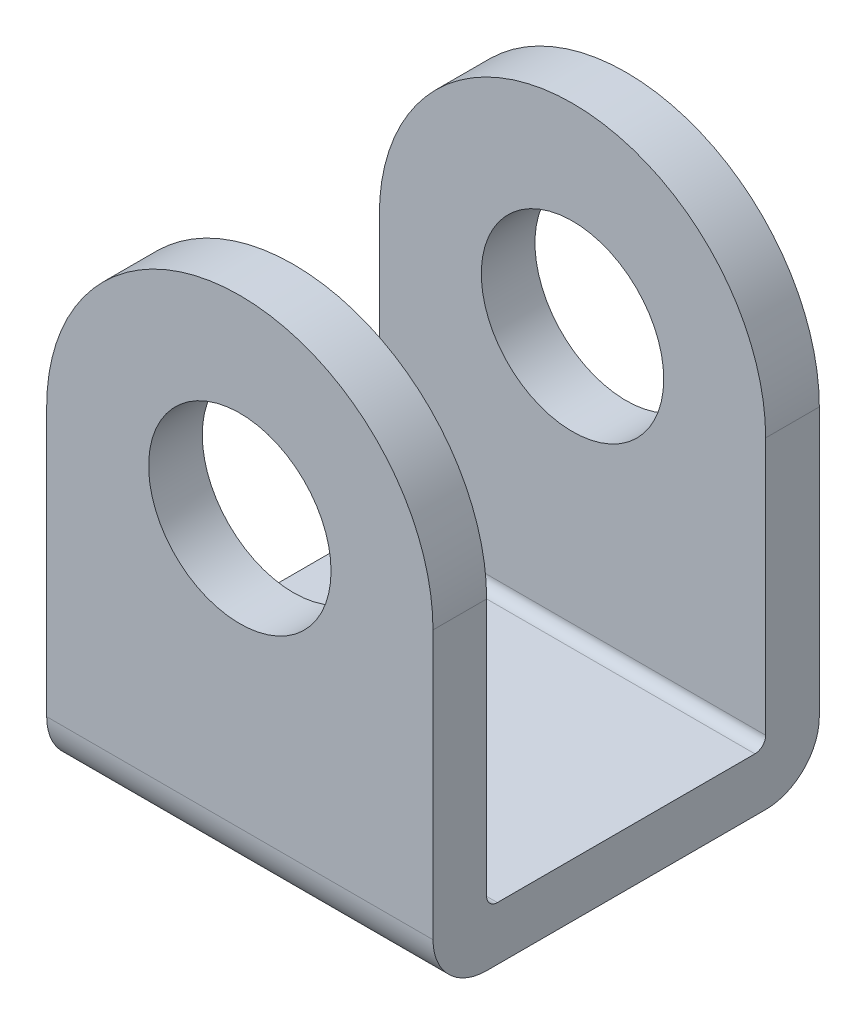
ISO-10303-21;
HEADER;
FILE_DESCRIPTION(('STEP AP214'),'2;1');
FILE_NAME('part.step','',(''),(''),'','','');
FILE_SCHEMA(('AUTOMOTIVE_DESIGN { 1 0 10303 214 1 1 1 1 }'));
ENDSEC;
DATA;
#1=APPLICATION_CONTEXT('core data for automotive mechanical design processes');
#2=APPLICATION_PROTOCOL_DEFINITION('international standard','automotive_design',2000,#1);
#3=PRODUCT_CONTEXT('',#1,'mechanical');
#4=PRODUCT('Part','Part','',(#3));
#5=PRODUCT_RELATED_PRODUCT_CATEGORY('part','',(#4));
#6=PRODUCT_DEFINITION_FORMATION('','',#4);
#7=PRODUCT_DEFINITION_CONTEXT('part definition',#1,'design');
#8=PRODUCT_DEFINITION('design','',#6,#7);
#9=PRODUCT_DEFINITION_SHAPE('','',#8);
#10=(LENGTH_UNIT() NAMED_UNIT(*) SI_UNIT(.MILLI.,.METRE.));
#11=(NAMED_UNIT(*) PLANE_ANGLE_UNIT() SI_UNIT($,.RADIAN.));
#12=(NAMED_UNIT(*) SI_UNIT($,.STERADIAN.) SOLID_ANGLE_UNIT());
#13=UNCERTAINTY_MEASURE_WITH_UNIT(LENGTH_MEASURE(1.E-05),#10,'distance_accuracy_value','');
#14=(GEOMETRIC_REPRESENTATION_CONTEXT(3) GLOBAL_UNCERTAINTY_ASSIGNED_CONTEXT((#13)) GLOBAL_UNIT_ASSIGNED_CONTEXT((#10,
#11,#12)) REPRESENTATION_CONTEXT('',''));
#15=CARTESIAN_POINT('',(0.,0.,0.));
#16=DIRECTION('',(0.,0.,1.));
#17=DIRECTION('',(1.,0.,0.));
#18=AXIS2_PLACEMENT_3D('',#15,#16,#17);
#19=CARTESIAN_POINT('',(-9.,0.,9.00000000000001));
#20=DIRECTION('',(1.,0.,0.));
#21=DIRECTION('',(0.,0.,-1.));
#22=AXIS2_PLACEMENT_3D('',#19,#20,#21);
#23=PLANE('',#22);
#24=DIRECTION('',(0.,-1.,0.));
#25=VECTOR('',#24,1.);
#26=CARTESIAN_POINT('',(-9.,0.,-9.00000000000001));
#27=LINE('',#26,#25);
#28=CARTESIAN_POINT('',(-9.,15.,-9.00000000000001));
#29=VERTEX_POINT('',#28);
#30=CARTESIAN_POINT('',(-9.,2.5,-9.00000000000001));
#31=VERTEX_POINT('',#30);
#32=EDGE_CURVE('E168',#29,#31,#27,.T.);
#33=ORIENTED_EDGE('',*,*,#32,.T.);
#34=CARTESIAN_POINT('',(-9.,2.5,-6.5));
#35=DIRECTION('',(1.,0.,0.));
#36=DIRECTION('',(0.,0.,-1.));
#37=AXIS2_PLACEMENT_3D('',#34,#35,#36);
#38=CIRCLE('',#37,2.5);
#39=CARTESIAN_POINT('',(-9.,0.,-6.5));
#40=VERTEX_POINT('',#39);
#41=EDGE_CURVE('E42',#31,#40,#38,.F.);
#42=ORIENTED_EDGE('',*,*,#41,.T.);
#43=DIRECTION('',(0.,0.,-1.));
#44=VECTOR('',#43,1.);
#45=CARTESIAN_POINT('',(-9.,0.,9.00000000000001));
#46=LINE('',#45,#44);
#47=CARTESIAN_POINT('',(-9.,0.,6.5));
#48=VERTEX_POINT('',#47);
#49=EDGE_CURVE('E192',#48,#40,#46,.T.);
#50=ORIENTED_EDGE('',*,*,#49,.F.);
#51=CARTESIAN_POINT('',(-9.,2.5,6.5));
#52=DIRECTION('',(1.,0.,0.));
#53=DIRECTION('',(0.,0.,-1.));
#54=AXIS2_PLACEMENT_3D('',#51,#52,#53);
#55=CIRCLE('',#54,2.5);
#56=CARTESIAN_POINT('',(-9.,2.5,9.00000000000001));
#57=VERTEX_POINT('',#56);
#58=EDGE_CURVE('E49',#48,#57,#55,.F.);
#59=ORIENTED_EDGE('',*,*,#58,.T.);
#60=DIRECTION('',(0.,-1.,0.));
#61=VECTOR('',#60,1.);
#62=CARTESIAN_POINT('',(-9.,0.,9.00000000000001));
#63=LINE('',#62,#61);
#64=CARTESIAN_POINT('',(-9.,15.,9.00000000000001));
#65=VERTEX_POINT('',#64);
#66=EDGE_CURVE('E172',#65,#57,#63,.T.);
#67=ORIENTED_EDGE('',*,*,#66,.F.);
#68=DIRECTION('',(0.,0.,1.));
#69=VECTOR('',#68,1.);
#70=CARTESIAN_POINT('',(-9.,15.,6.5));
#71=LINE('',#70,#69);
#72=CARTESIAN_POINT('',(-9.,15.,6.5));
#73=VERTEX_POINT('',#72);
#74=EDGE_CURVE('E165',#73,#65,#71,.T.);
#75=ORIENTED_EDGE('',*,*,#74,.F.);
#76=DIRECTION('',(0.,-1.,0.));
#77=VECTOR('',#76,1.);
#78=CARTESIAN_POINT('',(-9.,2.5,6.5));
#79=LINE('',#78,#77);
#80=CARTESIAN_POINT('',(-9.,3.,6.5));
#81=VERTEX_POINT('',#80);
#82=EDGE_CURVE('E161',#73,#81,#79,.T.);
#83=ORIENTED_EDGE('',*,*,#82,.T.);
#84=CARTESIAN_POINT('',(-9.,3.,6.));
#85=DIRECTION('',(1.,0.,0.));
#86=DIRECTION('',(0.,0.,-1.));
#87=AXIS2_PLACEMENT_3D('',#84,#85,#86);
#88=CIRCLE('',#87,0.5);
#89=CARTESIAN_POINT('',(-9.,2.5,6.));
#90=VERTEX_POINT('',#89);
#91=EDGE_CURVE('E407',#81,#90,#88,.T.);
#92=ORIENTED_EDGE('',*,*,#91,.T.);
#93=DIRECTION('',(0.,0.,-1.));
#94=VECTOR('',#93,1.);
#95=CARTESIAN_POINT('',(-9.,2.5,9.00000000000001));
#96=LINE('',#95,#94);
#97=CARTESIAN_POINT('',(-9.,2.5,-6.));
#98=VERTEX_POINT('',#97);
#99=EDGE_CURVE('E177',#90,#98,#96,.T.);
#100=ORIENTED_EDGE('',*,*,#99,.T.);
#101=CARTESIAN_POINT('',(-9.,3.,-6.));
#102=DIRECTION('',(1.,0.,0.));
#103=DIRECTION('',(0.,0.,-1.));
#104=AXIS2_PLACEMENT_3D('',#101,#102,#103);
#105=CIRCLE('',#104,0.5);
#106=CARTESIAN_POINT('',(-9.,3.,-6.5));
#107=VERTEX_POINT('',#106);
#108=EDGE_CURVE('E148',#98,#107,#105,.T.);
#109=ORIENTED_EDGE('',*,*,#108,.T.);
#110=DIRECTION('',(0.,-1.,0.));
#111=VECTOR('',#110,1.);
#112=CARTESIAN_POINT('',(-9.,2.5,-6.5));
#113=LINE('',#112,#111);
#114=CARTESIAN_POINT('',(-9.,15.,-6.5));
#115=VERTEX_POINT('',#114);
#116=EDGE_CURVE('E130',#115,#107,#113,.T.);
#117=ORIENTED_EDGE('',*,*,#116,.F.);
#118=DIRECTION('',(0.,0.,-1.));
#119=VECTOR('',#118,1.);
#120=CARTESIAN_POINT('',(-9.,15.,-6.5));
#121=LINE('',#120,#119);
#122=EDGE_CURVE('E140',#115,#29,#121,.T.);
#123=ORIENTED_EDGE('',*,*,#122,.T.);
#124=EDGE_LOOP('',(#33,#42,#50,#59,#67,#75,#83,#92,#100,#109,#117,#123));
#125=FACE_BOUND('',#124,.T.);
#126=ADVANCED_FACE('F34',(#125),#23,.F.);
#127=CARTESIAN_POINT('',(-9.,0.,9.00000000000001));
#128=DIRECTION('',(0.,1.,0.));
#129=DIRECTION('',(0.,0.,1.));
#130=AXIS2_PLACEMENT_3D('',#127,#128,#129);
#131=PLANE('',#130);
#132=ORIENTED_EDGE('',*,*,#49,.T.);
#133=DIRECTION('',(1.,0.,0.));
#134=VECTOR('',#133,1.);
#135=CARTESIAN_POINT('',(9.,0.,-6.5));
#136=LINE('',#135,#134);
#137=CARTESIAN_POINT('',(9.,0.,-6.5));
#138=VERTEX_POINT('',#137);
#139=EDGE_CURVE('E238',#40,#138,#136,.T.);
#140=ORIENTED_EDGE('',*,*,#139,.T.);
#141=DIRECTION('',(0.,0.,-1.));
#142=VECTOR('',#141,1.);
#143=CARTESIAN_POINT('',(9.,0.,9.00000000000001));
#144=LINE('',#143,#142);
#145=CARTESIAN_POINT('',(9.,0.,6.5));
#146=VERTEX_POINT('',#145);
#147=EDGE_CURVE('E252',#146,#138,#144,.T.);
#148=ORIENTED_EDGE('',*,*,#147,.F.);
#149=DIRECTION('',(1.,0.,0.));
#150=VECTOR('',#149,1.);
#151=CARTESIAN_POINT('',(-9.,0.,6.5));
#152=LINE('',#151,#150);
#153=EDGE_CURVE('E233',#146,#48,#152,.F.);
#154=ORIENTED_EDGE('',*,*,#153,.T.);
#155=EDGE_LOOP('',(#132,#140,#148,#154));
#156=FACE_BOUND('',#155,.T.);
#157=ADVANCED_FACE('F251',(#156),#131,.F.);
#158=CARTESIAN_POINT('',(9.,0.,9.00000000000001));
#159=DIRECTION('',(-1.,0.,0.));
#160=DIRECTION('',(0.,0.,1.));
#161=AXIS2_PLACEMENT_3D('',#158,#159,#160);
#162=PLANE('',#161);
#163=ORIENTED_EDGE('',*,*,#147,.T.);
#164=CARTESIAN_POINT('',(9.,2.5,-6.5));
#165=DIRECTION('',(-1.,0.,0.));
#166=DIRECTION('',(0.,0.,1.));
#167=AXIS2_PLACEMENT_3D('',#164,#165,#166);
#168=CIRCLE('',#167,2.5);
#169=CARTESIAN_POINT('',(9.,2.5,-9.00000000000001));
#170=VERTEX_POINT('',#169);
#171=EDGE_CURVE('E237',#138,#170,#168,.F.);
#172=ORIENTED_EDGE('',*,*,#171,.T.);
#173=DIRECTION('',(0.,1.,0.));
#174=VECTOR('',#173,1.);
#175=CARTESIAN_POINT('',(9.,0.,-9.00000000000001));
#176=LINE('',#175,#174);
#177=CARTESIAN_POINT('',(9.,15.,-9.00000000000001));
#178=VERTEX_POINT('',#177);
#179=EDGE_CURVE('E175',#170,#178,#176,.T.);
#180=ORIENTED_EDGE('',*,*,#179,.T.);
#181=DIRECTION('',(0.,0.,-1.));
#182=VECTOR('',#181,1.);
#183=CARTESIAN_POINT('',(9.,15.,-6.5));
#184=LINE('',#183,#182);
#185=CARTESIAN_POINT('',(9.,15.,-6.5));
#186=VERTEX_POINT('',#185);
#187=EDGE_CURVE('E144',#186,#178,#184,.T.);
#188=ORIENTED_EDGE('',*,*,#187,.F.);
#189=DIRECTION('',(0.,1.,0.));
#190=VECTOR('',#189,1.);
#191=CARTESIAN_POINT('',(9.,15.,-6.5));
#192=LINE('',#191,#190);
#193=CARTESIAN_POINT('',(9.,3.,-6.5));
#194=VERTEX_POINT('',#193);
#195=EDGE_CURVE('E133',#194,#186,#192,.T.);
#196=ORIENTED_EDGE('',*,*,#195,.F.);
#197=CARTESIAN_POINT('',(9.,3.,-6.));
#198=DIRECTION('',(-1.,0.,0.));
#199=DIRECTION('',(0.,0.,1.));
#200=AXIS2_PLACEMENT_3D('',#197,#198,#199);
#201=CIRCLE('',#200,0.5);
#202=CARTESIAN_POINT('',(9.,2.5,-6.));
#203=VERTEX_POINT('',#202);
#204=EDGE_CURVE('E412',#194,#203,#201,.T.);
#205=ORIENTED_EDGE('',*,*,#204,.T.);
#206=DIRECTION('',(0.,0.,-1.));
#207=VECTOR('',#206,1.);
#208=CARTESIAN_POINT('',(9.,2.5,9.00000000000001));
#209=LINE('',#208,#207);
#210=CARTESIAN_POINT('',(9.,2.5,6.));
#211=VERTEX_POINT('',#210);
#212=EDGE_CURVE('E187',#211,#203,#209,.T.);
#213=ORIENTED_EDGE('',*,*,#212,.F.);
#214=CARTESIAN_POINT('',(9.,3.,6.));
#215=DIRECTION('',(-1.,0.,0.));
#216=DIRECTION('',(0.,0.,1.));
#217=AXIS2_PLACEMENT_3D('',#214,#215,#216);
#218=CIRCLE('',#217,0.5);
#219=CARTESIAN_POINT('',(9.,3.,6.5));
#220=VERTEX_POINT('',#219);
#221=EDGE_CURVE('E406',#211,#220,#218,.T.);
#222=ORIENTED_EDGE('',*,*,#221,.T.);
#223=DIRECTION('',(0.,1.,0.));
#224=VECTOR('',#223,1.);
#225=CARTESIAN_POINT('',(9.,15.,6.5));
#226=LINE('',#225,#224);
#227=CARTESIAN_POINT('',(9.,15.,6.5));
#228=VERTEX_POINT('',#227);
#229=EDGE_CURVE('E162',#220,#228,#226,.T.);
#230=ORIENTED_EDGE('',*,*,#229,.T.);
#231=DIRECTION('',(0.,0.,1.));
#232=VECTOR('',#231,1.);
#233=CARTESIAN_POINT('',(9.,15.,6.5));
#234=LINE('',#233,#232);
#235=CARTESIAN_POINT('',(9.,15.,9.00000000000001));
#236=VERTEX_POINT('',#235);
#237=EDGE_CURVE('E169',#228,#236,#234,.T.);
#238=ORIENTED_EDGE('',*,*,#237,.T.);
#239=DIRECTION('',(0.,1.,0.));
#240=VECTOR('',#239,1.);
#241=CARTESIAN_POINT('',(9.,0.,9.00000000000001));
#242=LINE('',#241,#240);
#243=CARTESIAN_POINT('',(9.,2.5,9.00000000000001));
#244=VERTEX_POINT('',#243);
#245=EDGE_CURVE('E174',#244,#236,#242,.T.);
#246=ORIENTED_EDGE('',*,*,#245,.F.);
#247=CARTESIAN_POINT('',(9.,2.5,6.5));
#248=DIRECTION('',(-1.,0.,0.));
#249=DIRECTION('',(0.,0.,1.));
#250=AXIS2_PLACEMENT_3D('',#247,#248,#249);
#251=CIRCLE('',#250,2.5);
#252=EDGE_CURVE('E232',#244,#146,#251,.F.);
#253=ORIENTED_EDGE('',*,*,#252,.T.);
#254=EDGE_LOOP('',(#163,#172,#180,#188,#196,#205,#213,#222,#230,#238,#246,#253));
#255=FACE_BOUND('',#254,.T.);
#256=ADVANCED_FACE('F254',(#255),#162,.F.);
#257=CARTESIAN_POINT('',(-9.,2.5,9.00000000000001));
#258=DIRECTION('',(0.,-1.,0.));
#259=DIRECTION('',(1.,0.,0.));
#260=AXIS2_PLACEMENT_3D('',#257,#258,#259);
#261=PLANE('',#260);
#262=ORIENTED_EDGE('',*,*,#99,.F.);
#263=DIRECTION('',(1.,0.,0.));
#264=VECTOR('',#263,1.);
#265=CARTESIAN_POINT('',(-9.,2.5,6.));
#266=LINE('',#265,#264);
#267=EDGE_CURVE('E191',#90,#211,#266,.T.);
#268=ORIENTED_EDGE('',*,*,#267,.T.);
#269=ORIENTED_EDGE('',*,*,#212,.T.);
#270=DIRECTION('',(1.,0.,0.));
#271=VECTOR('',#270,1.);
#272=CARTESIAN_POINT('',(-9.,2.5,-6.));
#273=LINE('',#272,#271);
#274=EDGE_CURVE('E189',#203,#98,#273,.F.);
#275=ORIENTED_EDGE('',*,*,#274,.T.);
#276=EDGE_LOOP('',(#262,#268,#269,#275));
#277=FACE_BOUND('',#276,.T.);
#278=ADVANCED_FACE('F225',(#277),#261,.F.);
#279=CARTESIAN_POINT('',(0.,0.,9.00000000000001));
#280=DIRECTION('',(0.,0.,-1.));
#281=DIRECTION('',(-1.,0.,0.));
#282=AXIS2_PLACEMENT_3D('',#279,#280,#281);
#283=PLANE('',#282);
#284=CARTESIAN_POINT('',(0.,15.,9.00000000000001));
#285=DIRECTION('',(0.,0.,1.));
#286=DIRECTION('',(1.,0.,0.));
#287=AXIS2_PLACEMENT_3D('',#284,#285,#286);
#288=CIRCLE('',#287,4.25);
#289=CARTESIAN_POINT('',(4.25,15.,9.00000000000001));
#290=VERTEX_POINT('',#289);
#291=EDGE_CURVE('E212',#290,#290,#288,.T.);
#292=ORIENTED_EDGE('',*,*,#291,.F.);
#293=EDGE_LOOP('',(#292));
#294=FACE_BOUND('',#293,.T.);
#295=ORIENTED_EDGE('',*,*,#66,.T.);
#296=DIRECTION('',(1.,0.,0.));
#297=VECTOR('',#296,1.);
#298=CARTESIAN_POINT('',(0.,2.5,9.00000000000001));
#299=LINE('',#298,#297);
#300=EDGE_CURVE('E11',#57,#244,#299,.T.);
#301=ORIENTED_EDGE('',*,*,#300,.T.);
#302=ORIENTED_EDGE('',*,*,#245,.T.);
#303=CARTESIAN_POINT('',(0.,15.,9.00000000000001));
#304=DIRECTION('',(0.,0.,1.));
#305=DIRECTION('',(-1.,0.,0.));
#306=AXIS2_PLACEMENT_3D('',#303,#304,#305);
#307=CIRCLE('',#306,9.);
#308=EDGE_CURVE('E156',#236,#65,#307,.T.);
#309=ORIENTED_EDGE('',*,*,#308,.T.);
#310=EDGE_LOOP('',(#295,#301,#302,#309));
#311=FACE_BOUND('',#310,.T.);
#312=ADVANCED_FACE('F221',(#294,#311),#283,.F.);
#313=CARTESIAN_POINT('',(0.,0.,-9.00000000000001));
#314=DIRECTION('',(0.,0.,-1.));
#315=DIRECTION('',(-1.,0.,0.));
#316=AXIS2_PLACEMENT_3D('',#313,#314,#315);
#317=PLANE('',#316);
#318=CARTESIAN_POINT('',(0.,15.,-9.00000000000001));
#319=DIRECTION('',(0.,0.,1.));
#320=DIRECTION('',(1.,0.,0.));
#321=AXIS2_PLACEMENT_3D('',#318,#319,#320);
#322=CIRCLE('',#321,4.25);
#323=CARTESIAN_POINT('',(4.25,15.,-9.00000000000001));
#324=VERTEX_POINT('',#323);
#325=EDGE_CURVE('E207',#324,#324,#322,.T.);
#326=ORIENTED_EDGE('',*,*,#325,.T.);
#327=EDGE_LOOP('',(#326));
#328=FACE_BOUND('',#327,.T.);
#329=ORIENTED_EDGE('',*,*,#179,.F.);
#330=DIRECTION('',(1.,0.,0.));
#331=VECTOR('',#330,1.);
#332=CARTESIAN_POINT('',(-9.,2.5,-9.00000000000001));
#333=LINE('',#332,#331);
#334=EDGE_CURVE('E57',#170,#31,#333,.F.);
#335=ORIENTED_EDGE('',*,*,#334,.T.);
#336=ORIENTED_EDGE('',*,*,#32,.F.);
#337=CARTESIAN_POINT('',(0.,15.,-9.00000000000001));
#338=DIRECTION('',(0.,0.,1.));
#339=DIRECTION('',(-1.,0.,0.));
#340=AXIS2_PLACEMENT_3D('',#337,#338,#339);
#341=CIRCLE('',#340,9.);
#342=EDGE_CURVE('E143',#178,#29,#341,.T.);
#343=ORIENTED_EDGE('',*,*,#342,.F.);
#344=EDGE_LOOP('',(#329,#335,#336,#343));
#345=FACE_BOUND('',#344,.T.);
#346=ADVANCED_FACE('F224',(#328,#345),#317,.T.);
#347=CARTESIAN_POINT('',(0.,15.,6.5));
#348=DIRECTION('',(0.,0.,1.));
#349=DIRECTION('',(1.,0.,0.));
#350=AXIS2_PLACEMENT_3D('',#347,#348,#349);
#351=CYLINDRICAL_SURFACE('',#350,9.);
#352=ORIENTED_EDGE('',*,*,#308,.F.);
#353=ORIENTED_EDGE('',*,*,#237,.F.);
#354=CARTESIAN_POINT('',(0.,15.,6.5));
#355=DIRECTION('',(0.,0.,1.));
#356=DIRECTION('',(-1.,0.,0.));
#357=AXIS2_PLACEMENT_3D('',#354,#355,#356);
#358=CIRCLE('',#357,9.);
#359=EDGE_CURVE('E158',#228,#73,#358,.T.);
#360=ORIENTED_EDGE('',*,*,#359,.T.);
#361=ORIENTED_EDGE('',*,*,#74,.T.);
#362=EDGE_LOOP('',(#352,#353,#360,#361));
#363=FACE_BOUND('',#362,.T.);
#364=ADVANCED_FACE('F256',(#363),#351,.T.);
#365=CARTESIAN_POINT('',(0.,15.,6.5));
#366=DIRECTION('',(0.,0.,-1.));
#367=DIRECTION('',(-1.,0.,0.));
#368=AXIS2_PLACEMENT_3D('',#365,#366,#367);
#369=PLANE('',#368);
#370=CARTESIAN_POINT('',(0.,15.,6.5));
#371=DIRECTION('',(0.,0.,-1.));
#372=DIRECTION('',(-1.,0.,0.));
#373=AXIS2_PLACEMENT_3D('',#370,#371,#372);
#374=CIRCLE('',#373,4.25);
#375=CARTESIAN_POINT('',(-4.25,15.,6.5));
#376=VERTEX_POINT('',#375);
#377=EDGE_CURVE('E150',#376,#376,#374,.T.);
#378=ORIENTED_EDGE('',*,*,#377,.F.);
#379=EDGE_LOOP('',(#378));
#380=FACE_BOUND('',#379,.T.);
#381=ORIENTED_EDGE('',*,*,#229,.F.);
#382=DIRECTION('',(1.,0.,0.));
#383=VECTOR('',#382,1.);
#384=CARTESIAN_POINT('',(0.,3.,6.5));
#385=LINE('',#384,#383);
#386=EDGE_CURVE('E195',#220,#81,#385,.F.);
#387=ORIENTED_EDGE('',*,*,#386,.T.);
#388=ORIENTED_EDGE('',*,*,#82,.F.);
#389=ORIENTED_EDGE('',*,*,#359,.F.);
#390=EDGE_LOOP('',(#381,#387,#388,#389));
#391=FACE_BOUND('',#390,.T.);
#392=ADVANCED_FACE('F261',(#380,#391),#369,.T.);
#393=CARTESIAN_POINT('',(0.,15.,-6.5));
#394=DIRECTION('',(0.,0.,-1.));
#395=DIRECTION('',(-1.,0.,0.));
#396=AXIS2_PLACEMENT_3D('',#393,#394,#395);
#397=CYLINDRICAL_SURFACE('',#396,9.);
#398=ORIENTED_EDGE('',*,*,#342,.T.);
#399=ORIENTED_EDGE('',*,*,#122,.F.);
#400=CARTESIAN_POINT('',(0.,15.,-6.5));
#401=DIRECTION('',(0.,0.,1.));
#402=DIRECTION('',(-1.,0.,0.));
#403=AXIS2_PLACEMENT_3D('',#400,#401,#402);
#404=CIRCLE('',#403,9.);
#405=EDGE_CURVE('E125',#186,#115,#404,.T.);
#406=ORIENTED_EDGE('',*,*,#405,.F.);
#407=ORIENTED_EDGE('',*,*,#187,.T.);
#408=EDGE_LOOP('',(#398,#399,#406,#407));
#409=FACE_BOUND('',#408,.T.);
#410=ADVANCED_FACE('F141',(#409),#397,.T.);
#411=CARTESIAN_POINT('',(0.,15.,-6.5));
#412=DIRECTION('',(0.,0.,1.));
#413=DIRECTION('',(-1.,0.,0.));
#414=AXIS2_PLACEMENT_3D('',#411,#412,#413);
#415=PLANE('',#414);
#416=CARTESIAN_POINT('',(0.,15.,-6.5));
#417=DIRECTION('',(0.,0.,1.));
#418=DIRECTION('',(1.,0.,0.));
#419=AXIS2_PLACEMENT_3D('',#416,#417,#418);
#420=CIRCLE('',#419,4.25);
#421=CARTESIAN_POINT('',(4.25,15.,-6.5));
#422=VERTEX_POINT('',#421);
#423=EDGE_CURVE('E205',#422,#422,#420,.T.);
#424=ORIENTED_EDGE('',*,*,#423,.F.);
#425=EDGE_LOOP('',(#424));
#426=FACE_BOUND('',#425,.T.);
#427=ORIENTED_EDGE('',*,*,#116,.T.);
#428=DIRECTION('',(1.,0.,0.));
#429=VECTOR('',#428,1.);
#430=CARTESIAN_POINT('',(0.,3.,-6.5));
#431=LINE('',#430,#429);
#432=EDGE_CURVE('E408',#107,#194,#431,.T.);
#433=ORIENTED_EDGE('',*,*,#432,.T.);
#434=ORIENTED_EDGE('',*,*,#195,.T.);
#435=ORIENTED_EDGE('',*,*,#405,.T.);
#436=EDGE_LOOP('',(#427,#433,#434,#435));
#437=FACE_BOUND('',#436,.T.);
#438=ADVANCED_FACE('F127',(#426,#437),#415,.T.);
#439=CARTESIAN_POINT('',(0.,15.,-9.00000000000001));
#440=DIRECTION('',(0.,0.,1.));
#441=DIRECTION('',(1.,0.,0.));
#442=AXIS2_PLACEMENT_3D('',#439,#440,#441);
#443=CYLINDRICAL_SURFACE('',#442,4.25);
#444=ORIENTED_EDGE('',*,*,#423,.T.);
#445=EDGE_LOOP('',(#444));
#446=FACE_BOUND('',#445,.T.);
#447=ORIENTED_EDGE('',*,*,#325,.F.);
#448=EDGE_LOOP('',(#447));
#449=FACE_BOUND('',#448,.T.);
#450=ADVANCED_FACE('F350',(#446,#449),#443,.F.);
#451=ORIENTED_EDGE('',*,*,#377,.T.);
#452=EDGE_LOOP('',(#451));
#453=FACE_BOUND('',#452,.T.);
#454=ORIENTED_EDGE('',*,*,#291,.T.);
#455=EDGE_LOOP('',(#454));
#456=FACE_BOUND('',#455,.T.);
#457=ADVANCED_FACE('F219',(#453,#456),#443,.F.);
#458=CARTESIAN_POINT('',(-9.,3.,6.));
#459=DIRECTION('',(1.,0.,0.));
#460=DIRECTION('',(0.,1.,0.));
#461=AXIS2_PLACEMENT_3D('',#458,#459,#460);
#462=CYLINDRICAL_SURFACE('',#461,0.5);
#463=ORIENTED_EDGE('',*,*,#91,.F.);
#464=ORIENTED_EDGE('',*,*,#386,.F.);
#465=ORIENTED_EDGE('',*,*,#221,.F.);
#466=ORIENTED_EDGE('',*,*,#267,.F.);
#467=EDGE_LOOP('',(#463,#464,#465,#466));
#468=FACE_BOUND('',#467,.T.);
#469=ADVANCED_FACE('F273',(#468),#462,.F.);
#470=CARTESIAN_POINT('',(0.,3.,-6.));
#471=DIRECTION('',(1.,0.,0.));
#472=DIRECTION('',(0.,1.,0.));
#473=AXIS2_PLACEMENT_3D('',#470,#471,#472);
#474=CYLINDRICAL_SURFACE('',#473,0.5);
#475=ORIENTED_EDGE('',*,*,#108,.F.);
#476=ORIENTED_EDGE('',*,*,#274,.F.);
#477=ORIENTED_EDGE('',*,*,#204,.F.);
#478=ORIENTED_EDGE('',*,*,#432,.F.);
#479=EDGE_LOOP('',(#475,#476,#477,#478));
#480=FACE_BOUND('',#479,.T.);
#481=ADVANCED_FACE('F276',(#480),#474,.F.);
#482=CARTESIAN_POINT('',(-9.,2.5,-6.5));
#483=DIRECTION('',(-1.,0.,0.));
#484=DIRECTION('',(0.,0.,1.));
#485=AXIS2_PLACEMENT_3D('',#482,#483,#484);
#486=CYLINDRICAL_SURFACE('',#485,2.5);
#487=ORIENTED_EDGE('',*,*,#41,.F.);
#488=ORIENTED_EDGE('',*,*,#334,.F.);
#489=ORIENTED_EDGE('',*,*,#171,.F.);
#490=ORIENTED_EDGE('',*,*,#139,.F.);
#491=EDGE_LOOP('',(#487,#488,#489,#490));
#492=FACE_BOUND('',#491,.T.);
#493=ADVANCED_FACE('F253',(#492),#486,.T.);
#494=CARTESIAN_POINT('',(0.,2.5,6.5));
#495=DIRECTION('',(1.,0.,0.));
#496=DIRECTION('',(0.,0.,-1.));
#497=AXIS2_PLACEMENT_3D('',#494,#495,#496);
#498=CYLINDRICAL_SURFACE('',#497,2.5);
#499=ORIENTED_EDGE('',*,*,#58,.F.);
#500=ORIENTED_EDGE('',*,*,#153,.F.);
#501=ORIENTED_EDGE('',*,*,#252,.F.);
#502=ORIENTED_EDGE('',*,*,#300,.F.);
#503=EDGE_LOOP('',(#499,#500,#501,#502));
#504=FACE_BOUND('',#503,.T.);
#505=ADVANCED_FACE('F36',(#504),#498,.T.);
#506=CLOSED_SHELL('',(#126,#157,#256,#278,#312,#346,#364,#392,#410,#438,#450,#457,#469,#481,
#493,#505));
#507=MANIFOLD_SOLID_BREP('B2',#506);
#508=ADVANCED_BREP_SHAPE_REPRESENTATION('',(#18,#507),#14);
#509=SHAPE_DEFINITION_REPRESENTATION(#9,#508);
ENDSEC;
END-ISO-10303-21;
